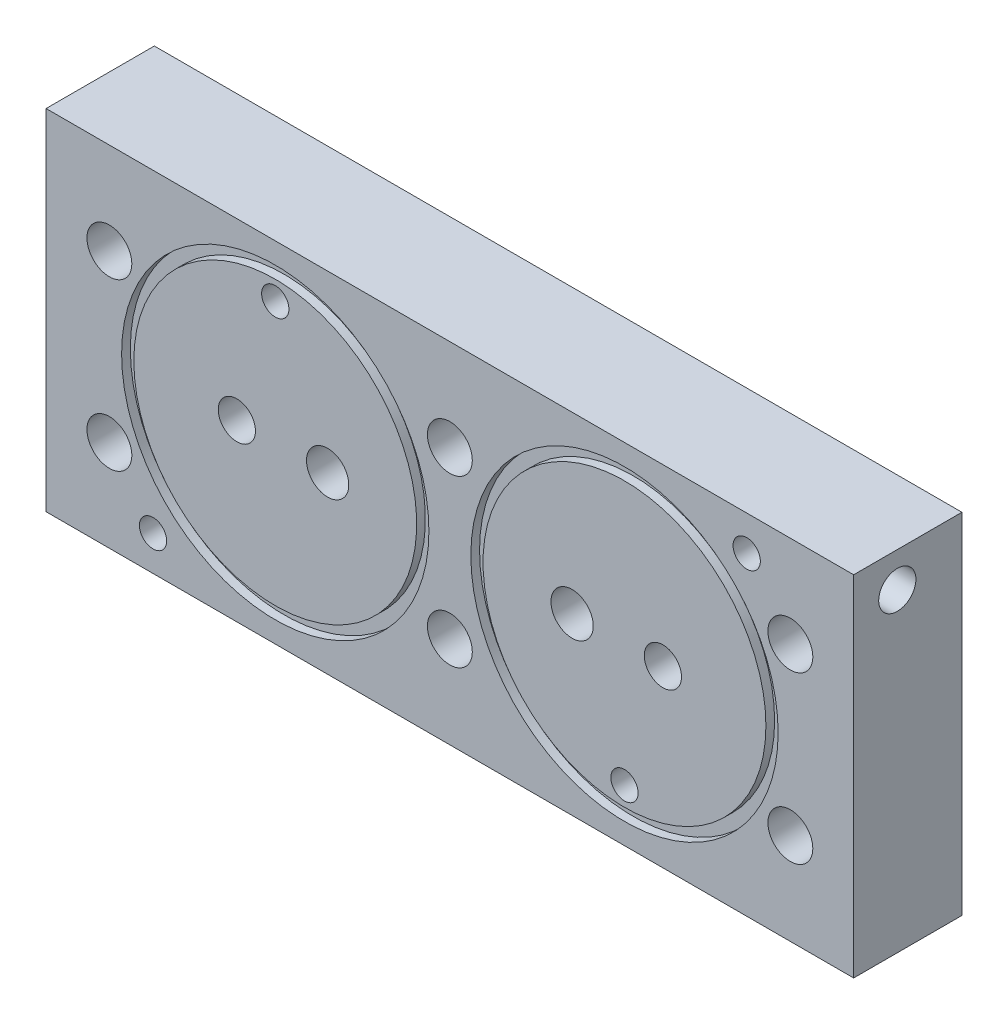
from build123d import *

# Parameters (mm, degrees)
SKETCH1_W                           = 117.475
SKETCH1_H                           = 50.8
EXTRUDE1_DEPTH                      = 7.874
SKETCH2_R                           = 3.2639
CUT_EXTRUDE1_DEPTH                  = 66.90336418
F_5_32_0_15625_DIAMETER_HOLE1_D     = 3.96875
F_5_32_0_15625_DIAMETER_HOLE1_DEPTH = 8.89
F_5_32_0_15625_DIAMETER_HOLE1_TIP   = 1.192332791
F_5_32_0_15625_DIAMETER_HOLE2_D     = 3.96875
F_5_32_0_15625_DIAMETER_HOLE2_DEPTH = 8.89
F_5_32_0_15625_DIAMETER_HOLE2_TIP   = 1.192332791
F_1_4_28_TAPPED_HOLE1_D             = 5.4102
SENSOR_PLUGS_AT_2_COUNT             = 2
SENSOR_PLUGS_AT_2_PITCH             = 35.56
SKETCH11_R                          = 22.352
SKETCH11_R_2                        = 20.574
CUT_EXTRUDE2_DEPTH                  = 1.27
SKETCH12_R                          = 6.7437
CUT_EXTRUDE3_DEPTH                  = 1.27
F_5_32_0_15625_DIAMETER_HOLE3_D     = 3.96875
F_5_32_0_15625_DIAMETER_HOLE3_DEPTH = 88.9
F_5_32_0_15625_DIAMETER_HOLE3_TIP   = 1.192332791
F_1_4_28_TAPPED_HOLE2_D             = 5.4102
F_1_4_28_TAPPED_HOLE2_DEPTH         = 9.07034
F_1_4_28_TAPPED_HOLE2_TIP           = 1.625388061
SKETCH17_R                          = 4.7625
CUT_EXTRUDE4_DEPTH                  = 3.302
F_5_32_0_15625_DIAMETER_HOLE4_D     = 3.96875
F_5_32_0_15625_DIAMETER_HOLE4_DEPTH = 88.9
F_5_32_0_15625_DIAMETER_HOLE4_TIP   = 1.192332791
F_1_4_28_TAPPED_HOLE4_D             = 5.4102
F_1_4_28_TAPPED_HOLE4_DEPTH         = 9.07034
F_1_4_28_TAPPED_HOLE4_TIP           = 1.625388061


with BuildPart() as part:
    # Sketch1 → Extrude1 (new, symmetric)
    with BuildSketch(Plane.XY):
        Rectangle(SKETCH1_W, SKETCH1_H)
    extrude(amount=EXTRUDE1_DEPTH, both=True)

    # Sketch2 → Cut-Extrude1 (cut, through all)
    with BuildSketch(Plane.XY.offset(7.874)):
        with Locations((-49.53, 12.065)):
            Circle(SKETCH2_R)
        with Locations((0, 12.065)):
            Circle(SKETCH2_R)
        with Locations(Location((49.53, 12.065, 0), (0, 0, 180))):
            Circle(SKETCH2_R)
        with Locations((49.53, -12.065)):
            Circle(SKETCH2_R)
        with Locations(Location((0, -12.065, 0), (0, 0, 180))):
            Circle(SKETCH2_R)
        with Locations(Location((-49.53, -12.065, 0), (0, 0, 180))):
            Circle(SKETCH2_R)
    extrude(amount=-CUT_EXTRUDE1_DEPTH, mode=Mode.SUBTRACT)

    # 5_32 _0.15625_ Diameter Hole1
    with Locations(Plane.XY.offset(7.874)):
        with Locations((-25.4, 17.78), (25.4, -17.78)):
            Hole(F_5_32_0_15625_DIAMETER_HOLE1_D / 2, depth=F_5_32_0_15625_DIAMETER_HOLE1_DEPTH)
            with Locations((0, 0, -(F_5_32_0_15625_DIAMETER_HOLE1_DEPTH + F_5_32_0_15625_DIAMETER_HOLE1_TIP / 2))):  # 118° drill point
                Cone(0, F_5_32_0_15625_DIAMETER_HOLE1_D / 2, F_5_32_0_15625_DIAMETER_HOLE1_TIP, mode=Mode.SUBTRACT)

    # 5_32 _0.15625_ Diameter Hole2
    with Locations(Plane.XY.offset(7.874)):
        with Locations((-43.18, -20.32), (43.18, 20.32)):
            Hole(F_5_32_0_15625_DIAMETER_HOLE2_D / 2, depth=F_5_32_0_15625_DIAMETER_HOLE2_DEPTH)
            with Locations((0, 0, -(F_5_32_0_15625_DIAMETER_HOLE2_DEPTH + F_5_32_0_15625_DIAMETER_HOLE2_TIP / 2))):  # 118° drill point
                Cone(0, F_5_32_0_15625_DIAMETER_HOLE2_D / 2, F_5_32_0_15625_DIAMETER_HOLE2_TIP, mode=Mode.SUBTRACT)

    # 1_4-28 Tapped Hole1 (through all)
    with Locations(Plane.XY.offset(7.874)):
        with Locations((-30.988, 0), (30.988, 0)):
            Hole(F_1_4_28_TAPPED_HOLE1_D / 2)

    # Sketch7 → Sensor Plugs (revolve, cut)
    with BuildSketch(Plane(origin=(17.78, 0, -7.874), x_dir=(0, 1, 0), z_dir=(1, 0, 0))):
        Polygon((0, 0), (0, 15.748), (3.0734, 15.748), (3.0734, 6.88594), (3.364811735, 6.88594), (3.570986, 0), align=None)
    sensor_plugs = revolve(axis=Axis((17.78, 0, -14.224), (0, 0, 1)), mode=Mode.SUBTRACT)

    # Sensor Plugs at 2: Sensor Plugs ×2
    with Locations(*[(-i * SENSOR_PLUGS_AT_2_PITCH, 0, 0) for i in range(1, SENSOR_PLUGS_AT_2_COUNT)]):
        add(sensor_plugs, mode=Mode.SUBTRACT)

    # Sketch11 → Cut-Extrude2 (cut)
    # profile 1 of 2: a face of its own
    with BuildSketch(Plane.XY.offset(7.874)):
        with Locations((25.4, 0)):
            Circle(SKETCH11_R)
        with Locations((25.4, 0)):
            Circle(SKETCH11_R_2, mode=Mode.SUBTRACT)
    # profile 2 of 2: a face of its own
    with BuildSketch(Plane.XY.offset(7.874)):
        with Locations(Location((-25.4, 0, 0), (0, 0, 180))):
            Circle(SKETCH11_R)
        with Locations(Location((-25.4, 0, 0), (0, 0, 180))):
            Circle(SKETCH11_R_2, mode=Mode.SUBTRACT)
    extrude(amount=-CUT_EXTRUDE2_DEPTH, mode=Mode.SUBTRACT)

    # Sketch12 → Cut-Extrude3 (cut)
    with BuildSketch(Plane(origin=(0, 0, -7.874), x_dir=(-1, 0, 0), z_dir=(0, 0, -1))):
        with Locations((-30.988, 0)):
            Circle(SKETCH12_R)
        with Locations((30.988, 0)):
            Circle(SKETCH12_R)
    extrude(amount=-CUT_EXTRUDE3_DEPTH, mode=Mode.SUBTRACT)

    # 5_32 _0.15625_ Diameter Hole3
    with Locations(Plane(origin=(58.7375, 0, 0), x_dir=(0, 0, -1), z_dir=(1, 0, 0))):
        with Locations((-1.524, 20.32)):
            Hole(F_5_32_0_15625_DIAMETER_HOLE3_D / 2, depth=F_5_32_0_15625_DIAMETER_HOLE3_DEPTH)
            with Locations((0, 0, -(F_5_32_0_15625_DIAMETER_HOLE3_DEPTH + F_5_32_0_15625_DIAMETER_HOLE3_TIP / 2))):  # 118° drill point
                Cone(0, F_5_32_0_15625_DIAMETER_HOLE3_D / 2, F_5_32_0_15625_DIAMETER_HOLE3_TIP, mode=Mode.SUBTRACT)

    # 1_4-28 Tapped Hole2
    with Locations(Plane(origin=(58.7375, 0, 0), x_dir=(0, 0, -1), z_dir=(1, 0, 0))):
        with Locations((-1.524, 20.32)):
            Hole(F_1_4_28_TAPPED_HOLE2_D / 2, depth=F_1_4_28_TAPPED_HOLE2_DEPTH)
            with Locations((0, 0, -(F_1_4_28_TAPPED_HOLE2_DEPTH + F_1_4_28_TAPPED_HOLE2_TIP / 2))):  # 118° drill point
                Cone(0, F_1_4_28_TAPPED_HOLE2_D / 2, F_1_4_28_TAPPED_HOLE2_TIP, mode=Mode.SUBTRACT)

    # Sketch17 → Cut-Extrude4 (cut)
    with BuildSketch(Plane(origin=(0, 0, -7.874), x_dir=(-1, 0, 0), z_dir=(0, 0, -1))):
        with Locations((0, 12.065)):
            Circle(SKETCH17_R)
        with Locations((-49.53, 12.065)):
            Circle(SKETCH17_R)
        with Locations((49.53, 12.065)):
            Circle(SKETCH17_R)
        with Locations((-49.53, -12.065)):
            Circle(SKETCH17_R)
        with Locations((49.53, -12.065)):
            Circle(SKETCH17_R)
        with Locations((0, -12.065)):
            Circle(SKETCH17_R)
    extrude(amount=-CUT_EXTRUDE4_DEPTH, mode=Mode.SUBTRACT)

    # 5_32 _0.15625_ Diameter Hole4
    with Locations(Plane.ZY.offset(58.7375)):
        with Locations((1.524, -20.32)):
            Hole(F_5_32_0_15625_DIAMETER_HOLE4_D / 2, depth=F_5_32_0_15625_DIAMETER_HOLE4_DEPTH)
            with Locations((0, 0, -(F_5_32_0_15625_DIAMETER_HOLE4_DEPTH + F_5_32_0_15625_DIAMETER_HOLE4_TIP / 2))):  # 118° drill point
                Cone(0, F_5_32_0_15625_DIAMETER_HOLE4_D / 2, F_5_32_0_15625_DIAMETER_HOLE4_TIP, mode=Mode.SUBTRACT)

    # 1_4-28 Tapped Hole4
    with Locations(Plane.ZY.offset(58.7375)):
        with Locations((1.524, -20.32)):
            Hole(F_1_4_28_TAPPED_HOLE4_D / 2, depth=F_1_4_28_TAPPED_HOLE4_DEPTH)
            with Locations((0, 0, -(F_1_4_28_TAPPED_HOLE4_DEPTH + F_1_4_28_TAPPED_HOLE4_TIP / 2))):  # 118° drill point
                Cone(0, F_1_4_28_TAPPED_HOLE4_D / 2, F_1_4_28_TAPPED_HOLE4_TIP, mode=Mode.SUBTRACT)


solid = part.part
